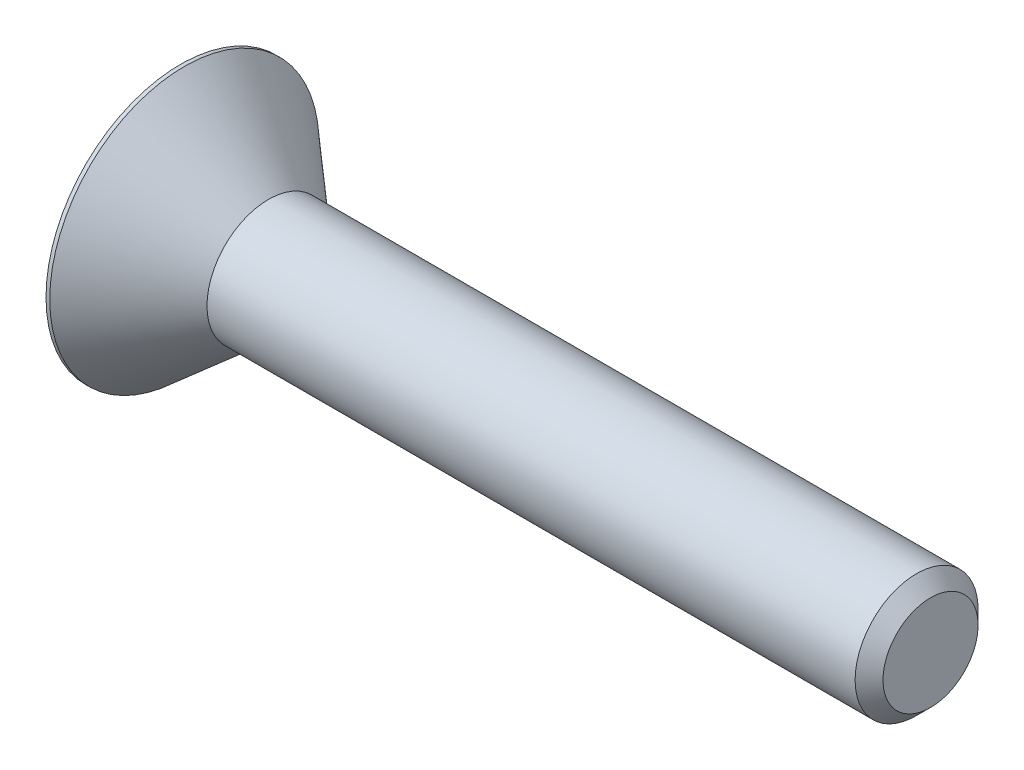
ISO-10303-21;
HEADER;
FILE_DESCRIPTION(('STEP AP214'),'2;1');
FILE_NAME('part.step','',(''),(''),'','','');
FILE_SCHEMA(('AUTOMOTIVE_DESIGN { 1 0 10303 214 1 1 1 1 }'));
ENDSEC;
DATA;
#1=APPLICATION_CONTEXT('core data for automotive mechanical design processes');
#2=APPLICATION_PROTOCOL_DEFINITION('international standard','automotive_design',2000,#1);
#3=PRODUCT_CONTEXT('',#1,'mechanical');
#4=PRODUCT('Part','Part','',(#3));
#5=PRODUCT_RELATED_PRODUCT_CATEGORY('part','',(#4));
#6=PRODUCT_DEFINITION_FORMATION('','',#4);
#7=PRODUCT_DEFINITION_CONTEXT('part definition',#1,'design');
#8=PRODUCT_DEFINITION('design','',#6,#7);
#9=PRODUCT_DEFINITION_SHAPE('','',#8);
#10=(LENGTH_UNIT() NAMED_UNIT(*) SI_UNIT(.MILLI.,.METRE.));
#11=(NAMED_UNIT(*) PLANE_ANGLE_UNIT() SI_UNIT($,.RADIAN.));
#12=(NAMED_UNIT(*) SI_UNIT($,.STERADIAN.) SOLID_ANGLE_UNIT());
#13=UNCERTAINTY_MEASURE_WITH_UNIT(LENGTH_MEASURE(1.E-05),#10,'distance_accuracy_value','');
#14=(GEOMETRIC_REPRESENTATION_CONTEXT(3) GLOBAL_UNCERTAINTY_ASSIGNED_CONTEXT((#13)) GLOBAL_UNIT_ASSIGNED_CONTEXT((#10,
#11,#12)) REPRESENTATION_CONTEXT('',''));
#15=CARTESIAN_POINT('',(0.,0.,0.));
#16=DIRECTION('',(0.,0.,1.));
#17=DIRECTION('',(1.,0.,0.));
#18=AXIS2_PLACEMENT_3D('',#15,#16,#17);
#19=CARTESIAN_POINT('',(0.,0.,0.));
#20=DIRECTION('',(-1.,0.,0.));
#21=DIRECTION('',(0.,0.,1.));
#22=AXIS2_PLACEMENT_3D('',#19,#20,#21);
#23=PLANE('',#22);
#24=CARTESIAN_POINT('',(0.,0.,0.));
#25=DIRECTION('',(-1.,0.,0.));
#26=DIRECTION('',(0.,0.,1.));
#27=AXIS2_PLACEMENT_3D('',#24,#25,#26);
#28=CIRCLE('',#27,4.5593);
#29=CARTESIAN_POINT('',(0.,0.,4.5593));
#30=VERTEX_POINT('',#29);
#31=EDGE_CURVE('E149',#30,#30,#28,.T.);
#32=ORIENTED_EDGE('',*,*,#31,.T.);
#33=EDGE_LOOP('',(#32));
#34=FACE_BOUND('',#33,.T.);
#35=DIRECTION('',(0.,-0.500000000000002,-0.866025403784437));
#36=VECTOR('',#35,1.);
#37=CARTESIAN_POINT('',(0.,-0.689240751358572,1.1938));
#38=LINE('',#37,#36);
#39=CARTESIAN_POINT('',(0.,-0.689240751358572,1.1938));
#40=VERTEX_POINT('',#39);
#41=CARTESIAN_POINT('',(0.,-1.37848150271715,0.));
#42=VERTEX_POINT('',#41);
#43=EDGE_CURVE('E121',#40,#42,#38,.T.);
#44=ORIENTED_EDGE('',*,*,#43,.T.);
#45=DIRECTION('',(0.,0.5,-0.866025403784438));
#46=VECTOR('',#45,1.);
#47=CARTESIAN_POINT('',(0.,-1.37848150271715,0.));
#48=LINE('',#47,#46);
#49=CARTESIAN_POINT('',(0.,-0.689240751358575,-1.1938));
#50=VERTEX_POINT('',#49);
#51=EDGE_CURVE('E51',#42,#50,#48,.T.);
#52=ORIENTED_EDGE('',*,*,#51,.T.);
#53=DIRECTION('',(0.,1.,0.));
#54=VECTOR('',#53,1.);
#55=CARTESIAN_POINT('',(0.,-0.689240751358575,-1.1938));
#56=LINE('',#55,#54);
#57=CARTESIAN_POINT('',(0.,0.689240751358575,-1.1938));
#58=VERTEX_POINT('',#57);
#59=EDGE_CURVE('E136',#50,#58,#56,.T.);
#60=ORIENTED_EDGE('',*,*,#59,.T.);
#61=DIRECTION('',(0.,0.5,0.866025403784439));
#62=VECTOR('',#61,1.);
#63=CARTESIAN_POINT('',(0.,0.689240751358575,-1.1938));
#64=LINE('',#63,#62);
#65=CARTESIAN_POINT('',(0.,1.37848150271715,0.));
#66=VERTEX_POINT('',#65);
#67=EDGE_CURVE('E366',#58,#66,#64,.T.);
#68=ORIENTED_EDGE('',*,*,#67,.T.);
#69=DIRECTION('',(0.,-0.499999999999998,0.86602540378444));
#70=VECTOR('',#69,1.);
#71=CARTESIAN_POINT('',(0.,1.37848150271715,0.));
#72=LINE('',#71,#70);
#73=CARTESIAN_POINT('',(0.,0.689240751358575,1.1938));
#74=VERTEX_POINT('',#73);
#75=EDGE_CURVE('E369',#66,#74,#72,.T.);
#76=ORIENTED_EDGE('',*,*,#75,.T.);
#77=DIRECTION('',(0.,-1.,0.));
#78=VECTOR('',#77,1.);
#79=CARTESIAN_POINT('',(0.,0.689240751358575,1.1938));
#80=LINE('',#79,#78);
#81=EDGE_CURVE('E372',#74,#40,#80,.T.);
#82=ORIENTED_EDGE('',*,*,#81,.T.);
#83=EDGE_LOOP('',(#44,#52,#60,#68,#76,#82));
#84=FACE_BOUND('',#83,.T.);
#85=ADVANCED_FACE('F36',(#34,#84),#23,.T.);
#86=CARTESIAN_POINT('',(25.4,1.61036,0.));
#87=DIRECTION('',(1.,0.,0.));
#88=DIRECTION('',(0.,0.,-1.));
#89=AXIS2_PLACEMENT_3D('',#86,#87,#88);
#90=PLANE('',#89);
#91=CARTESIAN_POINT('',(25.4,0.,0.));
#92=DIRECTION('',(-1.,0.,0.));
#93=DIRECTION('',(0.,0.,1.));
#94=AXIS2_PLACEMENT_3D('',#91,#92,#93);
#95=CIRCLE('',#94,1.61036);
#96=CARTESIAN_POINT('',(25.4,0.,1.61036));
#97=VERTEX_POINT('',#96);
#98=EDGE_CURVE('E11',#97,#97,#95,.T.);
#99=ORIENTED_EDGE('',*,*,#98,.F.);
#100=EDGE_LOOP('',(#99));
#101=FACE_BOUND('',#100,.T.);
#102=ADVANCED_FACE('F38',(#101),#90,.T.);
#103=CARTESIAN_POINT('',(25.4,0.,0.));
#104=DIRECTION('',(-1.,0.,0.));
#105=DIRECTION('',(0.,0.,1.));
#106=AXIS2_PLACEMENT_3D('',#103,#104,#105);
#107=CONICAL_SURFACE('',#106,1.61036,0.785398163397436);
#108=CARTESIAN_POINT('',(24.92756,0.,0.));
#109=DIRECTION('',(-1.,0.,0.));
#110=DIRECTION('',(0.,0.,1.));
#111=AXIS2_PLACEMENT_3D('',#108,#109,#110);
#112=CIRCLE('',#111,2.0828);
#113=CARTESIAN_POINT('',(24.92756,0.,2.0828));
#114=VERTEX_POINT('',#113);
#115=EDGE_CURVE('E44',#114,#114,#112,.T.);
#116=ORIENTED_EDGE('',*,*,#115,.F.);
#117=EDGE_LOOP('',(#116));
#118=FACE_BOUND('',#117,.T.);
#119=ORIENTED_EDGE('',*,*,#98,.T.);
#120=EDGE_LOOP('',(#119));
#121=FACE_BOUND('',#120,.T.);
#122=ADVANCED_FACE('F164',(#118,#121),#107,.T.);
#123=CARTESIAN_POINT('',(0.,0.,0.));
#124=DIRECTION('',(-1.,0.,0.));
#125=DIRECTION('',(0.,0.,1.));
#126=AXIS2_PLACEMENT_3D('',#123,#124,#125);
#127=CYLINDRICAL_SURFACE('',#126,2.0828);
#128=ORIENTED_EDGE('',*,*,#115,.T.);
#129=EDGE_LOOP('',(#128));
#130=FACE_BOUND('',#129,.T.);
#131=CARTESIAN_POINT('',(2.97588736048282,0.,0.));
#132=DIRECTION('',(-1.,0.,0.));
#133=DIRECTION('',(0.,0.,1.));
#134=AXIS2_PLACEMENT_3D('',#131,#132,#133);
#135=CIRCLE('',#134,2.0828);
#136=CARTESIAN_POINT('',(2.97588736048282,0.,2.0828));
#137=VERTEX_POINT('',#136);
#138=EDGE_CURVE('E156',#137,#137,#135,.T.);
#139=ORIENTED_EDGE('',*,*,#138,.F.);
#140=EDGE_LOOP('',(#139));
#141=FACE_BOUND('',#140,.T.);
#142=ADVANCED_FACE('F161',(#130,#141),#127,.T.);
#143=CARTESIAN_POINT('',(0.127,0.,0.));
#144=DIRECTION('',(-1.,0.,0.));
#145=DIRECTION('',(0.,0.,1.));
#146=AXIS2_PLACEMENT_3D('',#143,#144,#145);
#147=CONICAL_SURFACE('',#146,4.5593,0.715584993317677);
#148=ORIENTED_EDGE('',*,*,#138,.T.);
#149=EDGE_LOOP('',(#148));
#150=FACE_BOUND('',#149,.T.);
#151=CARTESIAN_POINT('',(0.127,0.,0.));
#152=DIRECTION('',(-1.,0.,0.));
#153=DIRECTION('',(0.,0.,1.));
#154=AXIS2_PLACEMENT_3D('',#151,#152,#153);
#155=CIRCLE('',#154,4.5593);
#156=CARTESIAN_POINT('',(0.127,0.,4.5593));
#157=VERTEX_POINT('',#156);
#158=EDGE_CURVE('E153',#157,#157,#155,.T.);
#159=ORIENTED_EDGE('',*,*,#158,.F.);
#160=EDGE_LOOP('',(#159));
#161=FACE_BOUND('',#160,.T.);
#162=ADVANCED_FACE('F185',(#150,#161),#147,.T.);
#163=CARTESIAN_POINT('',(0.,0.,0.));
#164=DIRECTION('',(-1.,0.,0.));
#165=DIRECTION('',(0.,0.,1.));
#166=AXIS2_PLACEMENT_3D('',#163,#164,#165);
#167=CYLINDRICAL_SURFACE('',#166,4.5593);
#168=ORIENTED_EDGE('',*,*,#158,.T.);
#169=EDGE_LOOP('',(#168));
#170=FACE_BOUND('',#169,.T.);
#171=ORIENTED_EDGE('',*,*,#31,.F.);
#172=EDGE_LOOP('',(#171));
#173=FACE_BOUND('',#172,.T.);
#174=ADVANCED_FACE('F182',(#170,#173),#167,.T.);
#175=CARTESIAN_POINT('',(1.9304,-1.37848150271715,0.));
#176=DIRECTION('',(0.,0.866025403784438,0.5));
#177=DIRECTION('',(0.,-0.500000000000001,0.866025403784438));
#178=AXIS2_PLACEMENT_3D('',#175,#176,#177);
#179=PLANE('',#178);
#180=ORIENTED_EDGE('',*,*,#51,.F.);
#181=DIRECTION('',(-1.,0.,0.));
#182=VECTOR('',#181,1.);
#183=CARTESIAN_POINT('',(1.9304,-1.37848150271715,0.));
#184=LINE('',#183,#182);
#185=CARTESIAN_POINT('',(1.9304,-1.37848150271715,0.));
#186=VERTEX_POINT('',#185);
#187=EDGE_CURVE('E363',#186,#42,#184,.T.);
#188=ORIENTED_EDGE('',*,*,#187,.F.);
#189=DIRECTION('',(0.,0.5,-0.866025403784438));
#190=VECTOR('',#189,1.);
#191=CARTESIAN_POINT('',(1.9304,-1.37848150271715,0.));
#192=LINE('',#191,#190);
#193=CARTESIAN_POINT('',(1.9304,-1.03386112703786,-0.596900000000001));
#194=VERTEX_POINT('',#193);
#195=EDGE_CURVE('E118',#186,#194,#192,.T.);
#196=ORIENTED_EDGE('',*,*,#195,.T.);
#197=CARTESIAN_POINT('',(1.9304,-0.689240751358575,-1.1938));
#198=VERTEX_POINT('',#197);
#199=EDGE_CURVE('E112',#194,#198,#192,.T.);
#200=ORIENTED_EDGE('',*,*,#199,.T.);
#201=DIRECTION('',(-1.,0.,0.));
#202=VECTOR('',#201,1.);
#203=CARTESIAN_POINT('',(1.9304,-0.689240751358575,-1.1938));
#204=LINE('',#203,#202);
#205=EDGE_CURVE('E116',#198,#50,#204,.T.);
#206=ORIENTED_EDGE('',*,*,#205,.T.);
#207=EDGE_LOOP('',(#180,#188,#196,#200,#206));
#208=FACE_BOUND('',#207,.T.);
#209=ADVANCED_FACE('F114',(#208),#179,.T.);
#210=CARTESIAN_POINT('',(1.9304,-0.689240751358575,-1.1938));
#211=DIRECTION('',(0.,0.,1.));
#212=DIRECTION('',(0.,-1.,0.));
#213=AXIS2_PLACEMENT_3D('',#210,#211,#212);
#214=PLANE('',#213);
#215=ORIENTED_EDGE('',*,*,#59,.F.);
#216=ORIENTED_EDGE('',*,*,#205,.F.);
#217=DIRECTION('',(0.,1.,0.));
#218=VECTOR('',#217,1.);
#219=CARTESIAN_POINT('',(1.9304,-0.689240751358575,-1.1938));
#220=LINE('',#219,#218);
#221=CARTESIAN_POINT('',(1.9304,0.,-1.1938));
#222=VERTEX_POINT('',#221);
#223=EDGE_CURVE('E124',#198,#222,#220,.T.);
#224=ORIENTED_EDGE('',*,*,#223,.T.);
#225=CARTESIAN_POINT('',(1.9304,0.689240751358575,-1.1938));
#226=VERTEX_POINT('',#225);
#227=EDGE_CURVE('E131',#222,#226,#220,.T.);
#228=ORIENTED_EDGE('',*,*,#227,.T.);
#229=DIRECTION('',(-1.,0.,0.));
#230=VECTOR('',#229,1.);
#231=CARTESIAN_POINT('',(1.9304,0.689240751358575,-1.1938));
#232=LINE('',#231,#230);
#233=EDGE_CURVE('E138',#226,#58,#232,.T.);
#234=ORIENTED_EDGE('',*,*,#233,.T.);
#235=EDGE_LOOP('',(#215,#216,#224,#228,#234));
#236=FACE_BOUND('',#235,.T.);
#237=ADVANCED_FACE('F133',(#236),#214,.T.);
#238=CARTESIAN_POINT('',(1.9304,0.689240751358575,-1.1938));
#239=DIRECTION('',(0.,-0.866025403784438,0.5));
#240=DIRECTION('',(0.,-0.5,-0.866025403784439));
#241=AXIS2_PLACEMENT_3D('',#238,#239,#240);
#242=PLANE('',#241);
#243=ORIENTED_EDGE('',*,*,#67,.F.);
#244=ORIENTED_EDGE('',*,*,#233,.F.);
#245=DIRECTION('',(0.,0.5,0.866025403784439));
#246=VECTOR('',#245,1.);
#247=CARTESIAN_POINT('',(1.9304,0.689240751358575,-1.1938));
#248=LINE('',#247,#246);
#249=CARTESIAN_POINT('',(1.9304,1.03386112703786,-0.5969));
#250=VERTEX_POINT('',#249);
#251=EDGE_CURVE('E384',#226,#250,#248,.T.);
#252=ORIENTED_EDGE('',*,*,#251,.T.);
#253=CARTESIAN_POINT('',(1.9304,1.37848150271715,0.));
#254=VERTEX_POINT('',#253);
#255=EDGE_CURVE('E130',#250,#254,#248,.T.);
#256=ORIENTED_EDGE('',*,*,#255,.T.);
#257=DIRECTION('',(-1.,0.,0.));
#258=VECTOR('',#257,1.);
#259=CARTESIAN_POINT('',(1.9304,1.37848150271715,0.));
#260=LINE('',#259,#258);
#261=EDGE_CURVE('E144',#254,#66,#260,.T.);
#262=ORIENTED_EDGE('',*,*,#261,.T.);
#263=EDGE_LOOP('',(#243,#244,#252,#256,#262));
#264=FACE_BOUND('',#263,.T.);
#265=ADVANCED_FACE('F214',(#264),#242,.T.);
#266=CARTESIAN_POINT('',(1.9304,1.37848150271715,0.));
#267=DIRECTION('',(0.,-0.86602540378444,-0.499999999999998));
#268=DIRECTION('',(0.,0.499999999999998,-0.86602540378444));
#269=AXIS2_PLACEMENT_3D('',#266,#267,#268);
#270=PLANE('',#269);
#271=ORIENTED_EDGE('',*,*,#75,.F.);
#272=ORIENTED_EDGE('',*,*,#261,.F.);
#273=DIRECTION('',(0.,-0.499999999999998,0.86602540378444));
#274=VECTOR('',#273,1.);
#275=CARTESIAN_POINT('',(1.9304,1.37848150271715,0.));
#276=LINE('',#275,#274);
#277=CARTESIAN_POINT('',(1.9304,1.03386112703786,0.596899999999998));
#278=VERTEX_POINT('',#277);
#279=EDGE_CURVE('E59',#254,#278,#276,.T.);
#280=ORIENTED_EDGE('',*,*,#279,.T.);
#281=CARTESIAN_POINT('',(1.9304,0.689240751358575,1.1938));
#282=VERTEX_POINT('',#281);
#283=EDGE_CURVE('E346',#278,#282,#276,.T.);
#284=ORIENTED_EDGE('',*,*,#283,.T.);
#285=DIRECTION('',(-1.,0.,0.));
#286=VECTOR('',#285,1.);
#287=CARTESIAN_POINT('',(1.9304,0.689240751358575,1.1938));
#288=LINE('',#287,#286);
#289=EDGE_CURVE('E357',#282,#74,#288,.T.);
#290=ORIENTED_EDGE('',*,*,#289,.T.);
#291=EDGE_LOOP('',(#271,#272,#280,#284,#290));
#292=FACE_BOUND('',#291,.T.);
#293=ADVANCED_FACE('F221',(#292),#270,.T.);
#294=CARTESIAN_POINT('',(1.9304,0.689240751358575,1.1938));
#295=DIRECTION('',(0.,0.,-1.));
#296=DIRECTION('',(-1.,0.,0.));
#297=AXIS2_PLACEMENT_3D('',#294,#295,#296);
#298=PLANE('',#297);
#299=ORIENTED_EDGE('',*,*,#81,.F.);
#300=ORIENTED_EDGE('',*,*,#289,.F.);
#301=DIRECTION('',(0.,-1.,0.));
#302=VECTOR('',#301,1.);
#303=CARTESIAN_POINT('',(1.9304,0.689240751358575,1.1938));
#304=LINE('',#303,#302);
#305=CARTESIAN_POINT('',(1.9304,0.,1.1938));
#306=VERTEX_POINT('',#305);
#307=EDGE_CURVE('E345',#282,#306,#304,.T.);
#308=ORIENTED_EDGE('',*,*,#307,.T.);
#309=CARTESIAN_POINT('',(1.9304,-0.689240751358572,1.1938));
#310=VERTEX_POINT('',#309);
#311=EDGE_CURVE('E348',#306,#310,#304,.T.);
#312=ORIENTED_EDGE('',*,*,#311,.T.);
#313=DIRECTION('',(-1.,0.,0.));
#314=VECTOR('',#313,1.);
#315=CARTESIAN_POINT('',(1.9304,-0.689240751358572,1.1938));
#316=LINE('',#315,#314);
#317=EDGE_CURVE('E378',#310,#40,#316,.T.);
#318=ORIENTED_EDGE('',*,*,#317,.T.);
#319=EDGE_LOOP('',(#299,#300,#308,#312,#318));
#320=FACE_BOUND('',#319,.T.);
#321=ADVANCED_FACE('F229',(#320),#298,.T.);
#322=CARTESIAN_POINT('',(1.9304,-0.689240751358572,1.1938));
#323=DIRECTION('',(0.,0.866025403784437,-0.500000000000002));
#324=DIRECTION('',(0.,0.500000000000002,0.866025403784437));
#325=AXIS2_PLACEMENT_3D('',#322,#323,#324);
#326=PLANE('',#325);
#327=ORIENTED_EDGE('',*,*,#43,.F.);
#328=ORIENTED_EDGE('',*,*,#317,.F.);
#329=DIRECTION('',(0.,-0.500000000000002,-0.866025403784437));
#330=VECTOR('',#329,1.);
#331=CARTESIAN_POINT('',(1.9304,-0.689240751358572,1.1938));
#332=LINE('',#331,#330);
#333=CARTESIAN_POINT('',(1.9304,-1.03386112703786,0.596900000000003));
#334=VERTEX_POINT('',#333);
#335=EDGE_CURVE('E351',#310,#334,#332,.T.);
#336=ORIENTED_EDGE('',*,*,#335,.T.);
#337=EDGE_CURVE('E358',#334,#186,#332,.T.);
#338=ORIENTED_EDGE('',*,*,#337,.T.);
#339=ORIENTED_EDGE('',*,*,#187,.T.);
#340=EDGE_LOOP('',(#327,#328,#336,#338,#339));
#341=FACE_BOUND('',#340,.T.);
#342=ADVANCED_FACE('F236',(#341),#326,.T.);
#343=CARTESIAN_POINT('',(1.9304,-1.37848150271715,0.));
#344=DIRECTION('',(-1.,0.,0.));
#345=DIRECTION('',(0.,0.,1.));
#346=AXIS2_PLACEMENT_3D('',#343,#344,#345);
#347=PLANE('',#346);
#348=CARTESIAN_POINT('',(1.9304,0.,0.));
#349=DIRECTION('',(-1.,0.,0.));
#350=DIRECTION('',(0.,0.,1.));
#351=AXIS2_PLACEMENT_3D('',#348,#349,#350);
#352=CIRCLE('',#351,1.1938);
#353=EDGE_CURVE('E137',#334,#306,#352,.T.);
#354=ORIENTED_EDGE('',*,*,#353,.F.);
#355=ORIENTED_EDGE('',*,*,#335,.F.);
#356=ORIENTED_EDGE('',*,*,#311,.F.);
#357=EDGE_LOOP('',(#354,#355,#356));
#358=FACE_BOUND('',#357,.T.);
#359=ADVANCED_FACE('F244',(#358),#347,.T.);
#360=EDGE_CURVE('E141',#194,#334,#352,.T.);
#361=ORIENTED_EDGE('',*,*,#360,.F.);
#362=ORIENTED_EDGE('',*,*,#195,.F.);
#363=ORIENTED_EDGE('',*,*,#337,.F.);
#364=EDGE_LOOP('',(#361,#362,#363));
#365=FACE_BOUND('',#364,.T.);
#366=ADVANCED_FACE('F252',(#365),#347,.T.);
#367=EDGE_CURVE('E126',#222,#194,#352,.T.);
#368=ORIENTED_EDGE('',*,*,#367,.F.);
#369=ORIENTED_EDGE('',*,*,#223,.F.);
#370=ORIENTED_EDGE('',*,*,#199,.F.);
#371=EDGE_LOOP('',(#368,#369,#370));
#372=FACE_BOUND('',#371,.T.);
#373=ADVANCED_FACE('F125',(#372),#347,.T.);
#374=EDGE_CURVE('E386',#250,#222,#352,.T.);
#375=ORIENTED_EDGE('',*,*,#374,.F.);
#376=ORIENTED_EDGE('',*,*,#251,.F.);
#377=ORIENTED_EDGE('',*,*,#227,.F.);
#378=EDGE_LOOP('',(#375,#376,#377));
#379=FACE_BOUND('',#378,.T.);
#380=ADVANCED_FACE('F267',(#379),#347,.T.);
#381=EDGE_CURVE('E150',#278,#250,#352,.T.);
#382=ORIENTED_EDGE('',*,*,#381,.F.);
#383=ORIENTED_EDGE('',*,*,#279,.F.);
#384=ORIENTED_EDGE('',*,*,#255,.F.);
#385=EDGE_LOOP('',(#382,#383,#384));
#386=FACE_BOUND('',#385,.T.);
#387=ADVANCED_FACE('F273',(#386),#347,.T.);
#388=EDGE_CURVE('E143',#306,#278,#352,.T.);
#389=ORIENTED_EDGE('',*,*,#388,.F.);
#390=ORIENTED_EDGE('',*,*,#307,.F.);
#391=ORIENTED_EDGE('',*,*,#283,.F.);
#392=EDGE_LOOP('',(#389,#390,#391));
#393=FACE_BOUND('',#392,.T.);
#394=ADVANCED_FACE('F255',(#393),#347,.T.);
#395=CARTESIAN_POINT('',(1.9304,0.,0.));
#396=DIRECTION('',(-1.,0.,0.));
#397=DIRECTION('',(0.,0.,1.));
#398=AXIS2_PLACEMENT_3D('',#395,#396,#397);
#399=CONICAL_SURFACE('',#398,1.1938,1.04719755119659);
#400=CARTESIAN_POINT('',(2.61964075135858,0.,0.));
#401=VERTEX_POINT('',#400);
#402=VERTEX_LOOP('',#401);
#403=FACE_BOUND('',#402,.T.);
#404=ORIENTED_EDGE('',*,*,#388,.T.);
#405=ORIENTED_EDGE('',*,*,#381,.T.);
#406=ORIENTED_EDGE('',*,*,#374,.T.);
#407=ORIENTED_EDGE('',*,*,#367,.T.);
#408=ORIENTED_EDGE('',*,*,#360,.T.);
#409=ORIENTED_EDGE('',*,*,#353,.T.);
#410=EDGE_LOOP('',(#404,#405,#406,#407,#408,#409));
#411=FACE_BOUND('',#410,.T.);
#412=ADVANCED_FACE('F180',(#403,#411),#399,.F.);
#413=CLOSED_SHELL('',(#85,#102,#122,#142,#162,#174,#209,#237,#265,#293,#321,#342,#359,#366,#373,
#380,#387,#394,#412));
#414=MANIFOLD_SOLID_BREP('B2',#413);
#415=ADVANCED_BREP_SHAPE_REPRESENTATION('',(#18,#414),#14);
#416=SHAPE_DEFINITION_REPRESENTATION(#9,#415);
ENDSEC;
END-ISO-10303-21;
